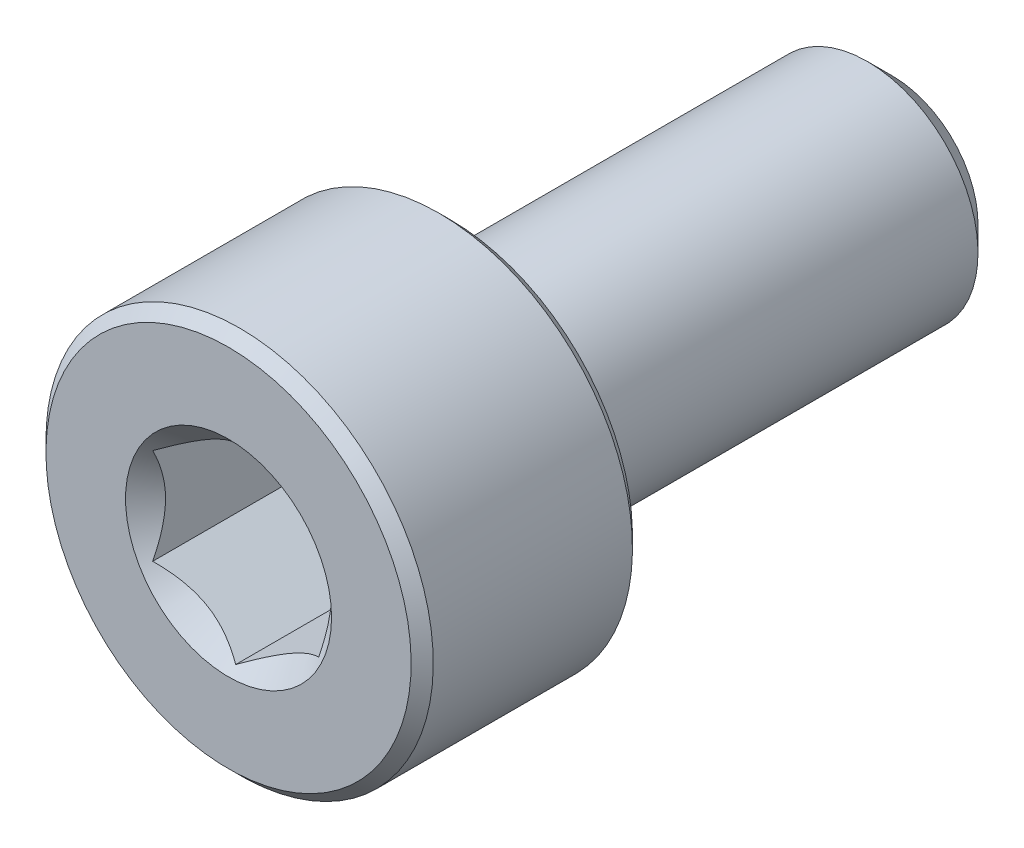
from build123d import *

# Parameters (mm, degrees)
CUT_EXTRUDE1_DEPTH = 3


with BuildPart() as part:
    # Sketch2 → Revolve1 (revolve)
    with BuildSketch(Plane(origin=(0, 0, 0), x_dir=(0, 0, -1), z_dir=(1, 0, 0))):
        with BuildLine():
            Line((-6, 0), (-6, 3.3))
            Line((-6, 3.3), (-5.8, 3.5))
            Line((-5.8, 3.5), (-2.2, 3.5))
            Line((-2.2, 3.5), (-2, 3.3))
            Line((-2, 3.3), (-2, 2.2))
            ThreePointArc((-2, 2.2), (-1.941421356, 2.058578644), (-1.8, 2))
            Line((-1.8, 2), (5.545336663, 2))
            Line((5.545336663, 2), (6, 1.545336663))
            Line((6, 1.545336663), (6, 0))
            Line((6, 0), (-6, 0))
        make_face()
    revolve(axis=Axis((0, 0, -6), (0, 0, 1)))

    # Sketch3 → Cut-Extrude1 (cut)
    with BuildSketch(Plane.XY.offset(6)):
        Polygon((1.5, -0.866025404), (1.5, 0.866025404), (0, 1.732050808), (-1.5, 0.866025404), (-1.5, -0.866025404), (0, -1.732050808), align=None)
    extrude(amount=-CUT_EXTRUDE1_DEPTH, mode=Mode.SUBTRACT)

    # Cut-Extrude2 cone 1 section (on through the dimple's axis) → Cut-Extrude2 (revolve, cut)
    with BuildSketch(Plane(origin=(0, 0, 6), x_dir=(0, -1, 0), z_dir=(1, 0, 0))):
        Polygon((0, 0), (1.861954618, 0), (0, 1.861954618), align=None)
    revolve(axis=Axis((0, 0, 6), (0, 0, -1)), mode=Mode.SUBTRACT)


solid = part.part
